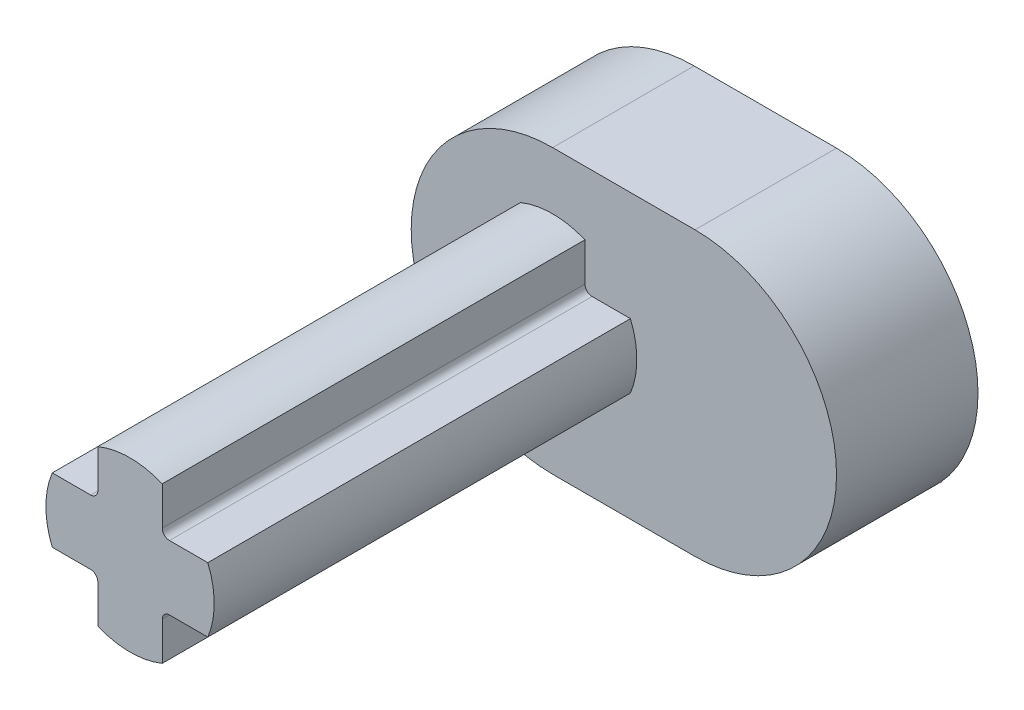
from build123d import *

# Parameters (mm, degrees)
BASE_EXTRUDE_DEPTH  = 3.95
CUT_EXTRUDE3_DEPTH  = 3.9
BOSS_EXTRUDE3_DEPTH = 0.05
CUT_EXTRUDE8_DEPTH  = 3.85
BOSS_EXTRUDE4_DEPTH = 11.8


with BuildPart() as part:
    # Sketch1 → Base-Extrude (new body)
    with BuildSketch(Plane.XY):
        with BuildLine():
            Line((3.975, 3.95), (0, 3.95))
            ThreePointArc((0, 3.95), (-3.95, 0), (0, -3.95))
            Line((0, -3.95), (3.975, -3.95))
            ThreePointArc((3.975, -3.95), (7.925, 0), (3.975, 3.95))
        make_face()
    extrude(amount=BASE_EXTRUDE_DEPTH)

    # Sketch7 → Cut-Extrude3 (cut)
    with BuildSketch(Plane(origin=(0, 0, 0), x_dir=(-1, 0, 0), z_dir=(0, 0, -1))):
        with BuildLine():
            Line((-1.298841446, 1.958446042), (-1.298841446, -1.958446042))
            ThreePointArc((-1.298841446, -1.958446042), (2.35, 0), (-1.298841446, 1.958446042))
        make_face()
    extrude(amount=-CUT_EXTRUDE3_DEPTH, mode=Mode.SUBTRACT)

    # Sketch8 → Boss-Extrude3 (add)
    # profile 1 of 6: a face of its own
    with BuildSketch(Plane(origin=(1.843932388, 2.125789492, 3.9), x_dir=(0, 1, 0), z_dir=(0, 0, -1))):
        with BuildLine():
            add(Edge.make_bspline(
                [(-2.74892309, -1.687794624), (-2.740545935, -1.688045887), (-2.72392366, -1.688544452), (-2.699306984, -1.691994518), (-2.675446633, -1.698063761), (-2.652311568, -1.706242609), (-2.63013259, -1.716677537), (-2.60907268, -1.729265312), (-2.589311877, -1.744091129), (-2.57732935, -1.755452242), (-2.571294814, -1.761173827)],
                knots=[0, 0, 0, 0, 1.018957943, 2.021855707, 3.0162028, 4.009185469, 5.002380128, 5.992645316, 6.989073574, 8, 8, 8, 8], degree=3))
            add(Edge.make_bspline(
                [(-2.571294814, -1.761173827), (-2.565662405, -1.767064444), (-2.554443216, -1.778797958), (-2.540046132, -1.798372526), (-2.527532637, -1.819132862), (-2.517418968, -1.841214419), (-2.509235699, -1.864191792), (-2.503547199, -1.887980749), (-2.499801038, -1.912367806), (-2.499422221, -1.92886935), (-2.499231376, -1.9371827)],
                knots=[0, 0, 0, 0, 1.000946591, 1.993784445, 2.979555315, 3.975955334, 4.974114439, 5.972928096, 6.978776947, 8, 8, 8, 8], degree=3))
            add(Edge.make_bspline(
                [(-2.499231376, -1.9371827), (-2.499431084, -1.945595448), (-2.499825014, -1.962189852), (-2.503383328, -1.986638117), (-2.509147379, -2.010195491), (-2.517163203, -2.032855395), (-2.52739387, -2.054470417), (-2.539868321, -2.074903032), (-2.554302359, -2.094334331), (-2.565592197, -2.105988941), (-2.571294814, -2.111875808)],
                knots=[0, 0, 0, 0, 1.039328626, 2.050107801, 3.04630548, 4.032829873, 5.015822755, 5.996291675, 6.987905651, 8, 8, 8, 8], degree=3))
            add(Edge.make_bspline(
                [(-2.571294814, -2.111875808), (-2.577457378, -2.117675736), (-2.589683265, -2.129182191), (-2.609929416, -2.144039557), (-2.631209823, -2.156964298), (-2.653577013, -2.167696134), (-2.676736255, -2.17611166), (-2.700445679, -2.182057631), (-2.724541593, -2.185885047), (-2.740778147, -2.1863417), (-2.74892309, -2.186570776)],
                knots=[0, 0, 0, 0, 1.026834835, 2.037133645, 3.042569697, 4.046736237, 5.044640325, 6.02933777, 7.011432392, 8, 8, 8, 8], degree=3))
            add(Edge.make_bspline(
                [(-2.74892309, -2.186570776), (-2.757100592, -2.186333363), (-2.773363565, -2.185861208), (-2.797434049, -2.182187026), (-2.820982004, -2.176333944), (-2.843810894, -2.167991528), (-2.865842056, -2.157518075), (-2.886616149, -2.144602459), (-2.906490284, -2.129860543), (-2.918469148, -2.118386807), (-2.924527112, -2.112584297)],
                knots=[0, 0, 0, 0, 1.00281557, 1.994345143, 2.98007901, 3.975109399, 4.971043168, 5.966942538, 6.971839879, 8, 8, 8, 8], degree=3))
            add(Edge.make_bspline(
                [(-2.924527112, -2.112584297), (-2.93029481, -2.106594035), (-2.941748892, -2.094697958), (-2.956443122, -2.074948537), (-2.969144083, -2.054121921), (-2.979644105, -2.032224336), (-2.987869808, -2.009363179), (-2.993750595, -1.985837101), (-2.997270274, -1.961681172), (-2.997760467, -1.945392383), (-2.998007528, -1.9371827)],
                knots=[0, 0, 0, 0, 1.021116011, 2.02783661, 3.017680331, 4.015421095, 5.006948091, 5.998492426, 6.991223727, 8, 8, 8, 8], degree=3))
            add(Edge.make_bspline(
                [(-2.998007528, -1.9371827), (-2.997766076, -1.929005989), (-2.997284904, -1.912711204), (-2.993653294, -1.88855578), (-2.987641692, -1.864893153), (-2.979223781, -1.841855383), (-2.968595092, -1.819598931), (-2.955869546, -1.798349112), (-2.941124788, -1.778149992), (-2.92968528, -1.76592046), (-2.923919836, -1.759756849)],
                knots=[0, 0, 0, 0, 0.994980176, 1.982825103, 2.965844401, 3.962221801, 4.963259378, 5.963294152, 6.973512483, 8, 8, 8, 8], degree=3))
            add(Edge.make_bspline(
                [(-2.923919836, -1.759756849), (-2.918055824, -1.754134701), (-2.906415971, -1.742974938), (-2.887125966, -1.728472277), (-2.866588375, -1.716031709), (-2.844772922, -1.705854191), (-2.821985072, -1.697696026), (-2.79830597, -1.691964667), (-2.773863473, -1.688389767), (-2.757302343, -1.687994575), (-2.74892309, -1.687794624)],
                knots=[0, 0, 0, 0, 1.00234497, 1.989618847, 2.972647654, 3.96216877, 4.956928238, 5.956152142, 6.965896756, 8, 8, 8, 8], degree=3))
        make_face()
        with BuildLine():
            add(Edge.make_bspline(
                [(-2.525141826, -1.937385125), (-2.52532674, -1.929951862), (-2.525694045, -1.91518672), (-2.528935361, -1.893346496), (-2.534214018, -1.872102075), (-2.5415201, -1.85153305), (-2.550720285, -1.831797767), (-2.561772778, -1.813072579), (-2.574803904, -1.795552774), (-2.584721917, -1.784871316), (-2.589715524, -1.779493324)],
                knots=[0, 0, 0, 0, 1.018933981, 2.023970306, 3.020439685, 4.01699499, 5.012615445, 6.002099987, 6.994080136, 8, 8, 8, 8], degree=3))
            add(Edge.make_bspline(
                [(-2.589715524, -1.779493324), (-2.595140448, -1.774306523), (-2.605886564, -1.764032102), (-2.623831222, -1.750908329), (-2.642641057, -1.739468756), (-2.662571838, -1.730204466), (-2.683214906, -1.722750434), (-2.70458467, -1.717506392), (-2.726555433, -1.714250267), (-2.741422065, -1.713887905), (-2.74892309, -1.713705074)],
                knots=[0, 0, 0, 0, 1.017557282, 2.015657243, 3.00970618, 4.001009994, 4.993000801, 5.983500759, 6.982566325, 8, 8, 8, 8], degree=3))
            add(Edge.make_bspline(
                [(-2.74892309, -1.713705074), (-2.756356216, -1.71389063), (-2.771121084, -1.71425921), (-2.79293087, -1.717486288), (-2.814105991, -1.722780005), (-2.834546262, -1.730068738), (-2.854099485, -1.739250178), (-2.872505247, -1.750391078), (-2.889868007, -1.763200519), (-2.900270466, -1.773167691), (-2.905499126, -1.778177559)],
                knots=[0, 0, 0, 0, 1.025734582, 2.03747875, 3.036079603, 4.034897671, 5.028729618, 6.012822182, 7.001171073, 8, 8, 8, 8], degree=3))
            add(Edge.make_bspline(
                [(-2.905499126, -1.778177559), (-2.910664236, -1.783756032), (-2.920893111, -1.794803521), (-2.934318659, -1.81285382), (-2.945795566, -1.831946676), (-2.955306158, -1.851988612), (-2.962780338, -1.872704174), (-2.968225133, -1.893905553), (-2.971401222, -1.915528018), (-2.971864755, -1.930087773), (-2.972097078, -1.937385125)],
                knots=[0, 0, 0, 0, 1.030362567, 2.040508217, 3.044001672, 4.046733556, 5.043824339, 6.025813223, 7.010537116, 8, 8, 8, 8], degree=3))
            add(Edge.make_bspline(
                [(-2.972097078, -1.937385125), (-2.971867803, -1.944682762), (-2.971412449, -1.959176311), (-2.968217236, -1.980696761), (-2.962773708, -2.00171594), (-2.955429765, -2.022249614), (-2.946024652, -2.042001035), (-2.934604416, -2.060672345), (-2.921429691, -2.078346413), (-2.911310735, -2.089062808), (-2.906207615, -2.094467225)],
                knots=[0, 0, 0, 0, 1.001897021, 1.989828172, 2.979668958, 3.97900318, 4.979796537, 5.977647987, 6.980101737, 8, 8, 8, 8], degree=3))
            add(Edge.make_bspline(
                [(-2.906207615, -2.094467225), (-2.900801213, -2.099567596), (-2.890046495, -2.109713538), (-2.872358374, -2.12295087), (-2.853615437, -2.134370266), (-2.833894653, -2.143888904), (-2.813373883, -2.151357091), (-2.792302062, -2.1567865), (-2.770747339, -2.15997015), (-2.756220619, -2.160429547), (-2.74892309, -2.160660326)],
                knots=[0, 0, 0, 0, 1.018033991, 2.025130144, 3.021157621, 4.022120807, 5.021202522, 6.009233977, 6.999934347, 8, 8, 8, 8], degree=3))
            add(Edge.make_bspline(
                [(-2.74892309, -2.160660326), (-2.741623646, -2.160440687), (-2.727054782, -2.160002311), (-2.705426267, -2.156630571), (-2.684147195, -2.151296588), (-2.663400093, -2.14363226), (-2.643323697, -2.134073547), (-2.624194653, -2.122572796), (-2.606155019, -2.109209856), (-2.595219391, -2.0989317), (-2.589715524, -2.093758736)],
                knots=[0, 0, 0, 0, 0.988726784, 1.973386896, 2.95907585, 3.956986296, 4.965064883, 5.967811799, 6.977205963, 8, 8, 8, 8], degree=3))
            add(Edge.make_bspline(
                [(-2.589715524, -2.093758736), (-2.584629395, -2.088503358), (-2.574526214, -2.078063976), (-2.561703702, -2.060583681), (-2.550341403, -2.042320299), (-2.541344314, -2.022819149), (-2.534064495, -2.002512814), (-2.528968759, -1.981407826), (-2.525674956, -1.959620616), (-2.525320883, -1.944853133), (-2.525141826, -1.937385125)],
                knots=[0, 0, 0, 0, 1.008934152, 2.004165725, 2.987050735, 3.975046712, 4.963888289, 5.961734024, 6.969236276, 8, 8, 8, 8], degree=3))
        make_face(mode=Mode.SUBTRACT)
    # profile 2 of 6: a face of its own
    with BuildSketch(Plane(origin=(1.843932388, 2.125789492, 3.9), x_dir=(0, 1, 0), z_dir=(0, 0, -1))):
        with BuildLine():
            add(Edge.make_bspline(
                [(-2.680604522, -1.873317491), (-2.681806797, -1.869111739), (-2.684152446, -1.860906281), (-2.690068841, -1.849790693), (-2.697443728, -1.840021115), (-2.706540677, -1.831945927), (-2.716943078, -1.825365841), (-2.728677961, -1.820715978), (-2.74156101, -1.817796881), (-2.750559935, -1.81749993), (-2.755198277, -1.817346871)],
                knots=[0, 0, 0, 0, 1.034583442, 2.018481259, 2.965600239, 3.922832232, 4.88602793, 5.869340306, 6.901787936, 8, 8, 8, 8], degree=3))
            add(Edge.make_bspline(
                [(-2.755198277, -1.817346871), (-2.758544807, -1.817437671), (-2.765104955, -1.817615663), (-2.774634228, -1.819196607), (-2.78362215, -1.821583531), (-2.792047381, -1.825056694), (-2.799831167, -1.829651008), (-2.807070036, -1.835151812), (-2.813748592, -1.841625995), (-2.819754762, -1.849093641), (-2.825140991, -1.857441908), (-2.829799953, -1.86660501), (-2.833742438, -1.876571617), (-2.836971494, -1.887342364), (-2.839477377, -1.898917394), (-2.841313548, -1.911289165), (-2.842270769, -1.92448231), (-2.842451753, -1.9335377), (-2.842544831, -1.938194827)],
                knots=[0, 0, 0, 0, 0.954364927, 1.870826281, 2.749014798, 3.603666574, 4.462321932, 5.321139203, 6.192652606, 7.109872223, 8.049900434, 9.023020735, 10.038511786, 11.104546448, 12.228195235, 13.415499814, 14.67080855, 16, 16, 16, 16], degree=3))
            add(Edge.make_bspline(
                [(-2.842544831, -1.938194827), (-2.842461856, -1.942650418), (-2.842300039, -1.951339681), (-2.84119489, -1.964024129), (-2.83929922, -1.976007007), (-2.836546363, -1.987265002), (-2.833131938, -1.997849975), (-2.828909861, -2.007707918), (-2.823754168, -2.016764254), (-2.818070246, -2.025184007), (-2.811577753, -2.032650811), (-2.80456285, -2.039224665), (-2.796928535, -2.044711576), (-2.788726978, -2.049196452), (-2.780025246, -2.052795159), (-2.770680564, -2.05516135), (-2.760853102, -2.056751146), (-2.75409151, -2.056928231), (-2.750643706, -2.057018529)],
                knots=[0, 0, 0, 0, 1.263666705, 2.46439412, 3.608060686, 4.701172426, 5.748162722, 6.759612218, 7.736430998, 8.699894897, 9.636077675, 10.536616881, 11.420945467, 12.294596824, 13.183057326, 14.083596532, 15.022806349, 16, 16, 16, 16], degree=3))
            add(Edge.make_bspline(
                [(-2.750643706, -2.057018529), (-2.745567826, -2.056797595), (-2.735685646, -2.056367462), (-2.721413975, -2.053224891), (-2.708338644, -2.047730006), (-2.696496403, -2.040281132), (-2.686243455, -2.030931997), (-2.677820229, -2.02006891), (-2.671362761, -2.007731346), (-2.668903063, -1.998745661), (-2.667649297, -1.994165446)],
                knots=[0, 0, 0, 0, 1.079119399, 2.10092667, 3.088298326, 4.081569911, 5.061799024, 6.023337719, 6.992448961, 8, 8, 8, 8], degree=3))
            Line((-2.667649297, -1.994165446), (-2.635261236, -1.994165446))
            add(Edge.make_bspline(
                [(-2.635261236, -1.994165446), (-2.635663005, -1.997585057), (-2.636457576, -2.004347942), (-2.638861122, -2.014156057), (-2.641937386, -2.023564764), (-2.646142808, -2.032401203), (-2.651254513, -2.040761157), (-2.657234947, -2.048679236), (-2.664161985, -2.056097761), (-2.671955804, -2.062934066), (-2.680361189, -2.069172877), (-2.689352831, -2.074575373), (-2.698804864, -2.079146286), (-2.708765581, -2.082898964), (-2.719231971, -2.085827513), (-2.730192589, -2.087969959), (-2.741642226, -2.089174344), (-2.74942643, -2.089328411), (-2.753376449, -2.08940659)],
                knots=[0, 0, 0, 0, 0.986260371, 1.95050462, 2.889531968, 3.819800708, 4.748761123, 5.694736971, 6.65970864, 7.65334055, 8.66317646, 9.65680837, 10.656120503, 11.66933233, 12.704332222, 13.768524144, 14.867659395, 16, 16, 16, 16], degree=3))
            add(Edge.make_bspline(
                [(-2.753376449, -2.08940659), (-2.758175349, -2.089314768), (-2.76754887, -2.089135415), (-2.781174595, -2.087013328), (-2.794025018, -2.083780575), (-2.806199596, -2.079352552), (-2.817542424, -2.07342589), (-2.828182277, -2.066279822), (-2.838044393, -2.057835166), (-2.84704038, -2.048092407), (-2.855069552, -2.037260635), (-2.862285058, -2.025584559), (-2.868090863, -2.01281948), (-2.872939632, -1.999236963), (-2.876832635, -1.98476086), (-2.879498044, -1.969381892), (-2.881167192, -1.953076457), (-2.881327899, -1.941910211), (-2.881410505, -1.936170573)],
                knots=[0, 0, 0, 0, 1.021960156, 1.996158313, 2.930921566, 3.843207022, 4.750120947, 5.651545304, 6.569508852, 7.510803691, 8.471453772, 9.439502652, 10.430355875, 11.453832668, 12.510809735, 13.620872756, 14.777088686, 16, 16, 16, 16], degree=3))
            add(Edge.make_bspline(
                [(-2.881410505, -1.936170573), (-2.881280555, -1.930566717), (-2.881027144, -1.919638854), (-2.879444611, -1.903686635), (-2.876600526, -1.888623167), (-2.872624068, -1.874420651), (-2.867734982, -1.860974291), (-2.861511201, -1.848478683), (-2.854177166, -1.836852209), (-2.845778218, -1.826159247), (-2.836528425, -1.816408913), (-2.826360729, -1.808016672), (-2.815566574, -1.800829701), (-2.804021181, -1.795060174), (-2.791794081, -1.790434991), (-2.778811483, -1.787256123), (-2.765145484, -1.785262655), (-2.755812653, -1.785061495), (-2.751048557, -1.78495881)],
                knots=[0, 0, 0, 0, 1.196898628, 2.334025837, 3.419361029, 4.466545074, 5.481092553, 6.470377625, 7.441922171, 8.411995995, 9.370087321, 10.306500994, 11.221801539, 12.13374922, 13.057210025, 14.007902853, 14.983101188, 16, 16, 16, 16], degree=3))
            add(Edge.make_bspline(
                [(-2.751048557, -1.78495881), (-2.747436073, -1.785043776), (-2.740328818, -1.785210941), (-2.729897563, -1.786312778), (-2.719875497, -1.788249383), (-2.710302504, -1.790983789), (-2.701125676, -1.794397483), (-2.692445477, -1.798727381), (-2.684172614, -1.803758), (-2.676388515, -1.8095264), (-2.669244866, -1.815862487), (-2.662799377, -1.822671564), (-2.657196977, -1.829997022), (-2.652452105, -1.83781616), (-2.64844479, -1.846028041), (-2.645449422, -1.854749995), (-2.643055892, -1.863843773), (-2.642181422, -1.870133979), (-2.641738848, -1.873317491)],
                knots=[0, 0, 0, 0, 1.121250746, 2.205965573, 3.251297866, 4.285503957, 5.292962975, 6.285785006, 7.291501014, 8.29470614, 9.288687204, 10.251738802, 11.200508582, 12.145166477, 13.086568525, 14.030471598, 15.003209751, 16, 16, 16, 16], degree=3))
            Line((-2.641738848, -1.873317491), (-2.680604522, -1.873317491))
        make_face()
    # profile 3 of 6: a face of its own
    with BuildSketch(Plane(origin=(1.843932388, 2.125789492, 3.9), x_dir=(0, 1, 0), z_dir=(0, 0, -1))):
        Polygon((-2.45388809, -2.180093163), (-2.347311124, -1.6748394), (-2.300449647, -1.6748394), (-2.400447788, -2.141227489), (-2.227171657, -2.141227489), (-2.235471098, -2.180093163), align=None)
    # profile 4 of 6: a face of its own
    with BuildSketch(Plane(origin=(1.843932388, 2.125789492, 3.9), x_dir=(0, 1, 0), z_dir=(0, 0, -1))):
        Polygon((-2.194783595, -2.180093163), (-2.089117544, -1.6748394), (-1.864425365, -1.6748394), (-1.872421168, -1.713705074), (-2.053187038, -1.713705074), (-2.092457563, -1.89507822), (-1.922723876, -1.89507822), (-1.930314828, -1.933943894), (-2.099947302, -1.933943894), (-2.141849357, -2.141227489), (-1.961589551, -2.141227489), (-1.968876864, -2.180093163), align=None)
    # profile 5 of 6: a face of its own
    with BuildSketch(Plane(origin=(1.843932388, 2.125789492, 3.9), x_dir=(0, 1, 0), z_dir=(0, 0, -1))):
        with BuildLine():
            add(Edge.make_bspline(
                [(-1.603903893, -2.170984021), (-1.609905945, -2.172181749), (-1.621592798, -2.174513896), (-1.638701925, -2.177636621), (-1.654918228, -2.180422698), (-1.670242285, -2.182628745), (-1.684649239, -2.18439339), (-1.698121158, -2.185559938), (-1.710636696, -2.18648995), (-1.718677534, -2.186544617), (-1.72252517, -2.186570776)],
                knots=[0, 0, 0, 0, 1.225832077, 2.386870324, 3.483325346, 4.521138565, 5.487527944, 6.389900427, 7.229548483, 8, 8, 8, 8], degree=3))
            add(Edge.make_bspline(
                [(-1.72252517, -2.186570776), (-1.728197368, -2.186488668), (-1.739229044, -2.18632898), (-1.755227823, -2.184665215), (-1.770156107, -2.182074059), (-1.78403585, -2.17846006), (-1.796810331, -2.173694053), (-1.808570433, -2.167948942), (-1.819158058, -2.160983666), (-1.828742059, -2.153083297), (-1.837206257, -2.144105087), (-1.844531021, -2.134104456), (-1.850760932, -2.123115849), (-1.8556757, -2.111040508), (-1.859625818, -2.098069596), (-1.862480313, -2.084080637), (-1.864040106, -2.06909842), (-1.864294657, -2.058776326), (-1.864425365, -2.053476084)],
                knots=[0, 0, 0, 0, 1.222313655, 2.377238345, 3.462882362, 4.486000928, 5.464004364, 6.397432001, 7.301091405, 8.189403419, 9.069130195, 9.953503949, 10.85555242, 11.784749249, 12.757873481, 13.774795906, 14.85739087, 16, 16, 16, 16], degree=3))
            add(Edge.make_bspline(
                [(-1.864425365, -2.053476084), (-1.864326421, -2.049493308), (-1.864110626, -2.040806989), (-1.862927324, -2.026759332), (-1.860974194, -2.010593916), (-1.858689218, -1.995808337), (-1.856631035, -1.9827451), (-1.854635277, -1.971973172), (-1.852698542, -1.960406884), (-1.850278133, -1.948189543), (-1.847919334, -1.935174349), (-1.845145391, -1.921457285), (-1.842224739, -1.906980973), (-1.840172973, -1.897101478), (-1.839122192, -1.892041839)],
                knots=[0, 0, 0, 0, 0.876487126, 1.911592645, 3.100341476, 4.458879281, 5.203351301, 6.010101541, 6.869316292, 7.783654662, 8.750433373, 9.779746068, 10.862929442, 12, 12, 12, 12], degree=3))
            add(Edge.make_bspline(
                [(-1.839122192, -1.892041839), (-1.838016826, -1.887013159), (-1.835871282, -1.87725236), (-1.832604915, -1.863021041), (-1.829473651, -1.849592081), (-1.826489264, -1.836952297), (-1.82341429, -1.825195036), (-1.820471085, -1.814232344), (-1.817673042, -1.8040665), (-1.814104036, -1.791886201), (-1.809694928, -1.778164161), (-1.804245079, -1.763367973), (-1.798896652, -1.750628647), (-1.794843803, -1.743098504), (-1.792969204, -1.739615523)],
                knots=[0, 0, 0, 0, 1.160392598, 2.252352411, 3.290740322, 4.268182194, 5.179221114, 6.029501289, 6.826431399, 7.555467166, 8.890004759, 10.073631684, 11.108980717, 12, 12, 12, 12], degree=3))
            add(Edge.make_bspline(
                [(-1.792969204, -1.739615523), (-1.789083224, -1.733359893), (-1.78150627, -1.721162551), (-1.767659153, -1.705185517), (-1.75249105, -1.691640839), (-1.735752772, -1.680641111), (-1.717357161, -1.672169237), (-1.697338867, -1.666120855), (-1.675588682, -1.662546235), (-1.660563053, -1.662109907), (-1.652789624, -1.661884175)],
                knots=[0, 0, 0, 0, 1.045860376, 2.039237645, 2.994234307, 3.929665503, 4.876250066, 5.864225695, 6.895068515, 8, 8, 8, 8], degree=3))
            add(Edge.make_bspline(
                [(-1.652789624, -1.661884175), (-1.647725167, -1.661976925), (-1.637842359, -1.662157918), (-1.623456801, -1.663690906), (-1.609915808, -1.666213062), (-1.597250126, -1.669693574), (-1.585528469, -1.674331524), (-1.574587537, -1.679733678), (-1.564625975, -1.686411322), (-1.555493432, -1.693971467), (-1.547405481, -1.702489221), (-1.540318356, -1.71180821), (-1.534339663, -1.721963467), (-1.529455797, -1.732967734), (-1.525758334, -1.744766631), (-1.522990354, -1.757322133), (-1.521364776, -1.770712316), (-1.521197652, -1.779927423), (-1.52111191, -1.784655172)],
                knots=[0, 0, 0, 0, 1.187988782, 2.318247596, 3.389450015, 4.41694543, 5.394441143, 6.343149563, 7.273990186, 8.201324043, 9.119525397, 10.023491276, 10.942545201, 11.878052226, 12.841830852, 13.83862194, 14.891119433, 16, 16, 16, 16], degree=3))
            add(Edge.make_bspline(
                [(-1.52111191, -1.784655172), (-1.521169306, -1.78644365), (-1.521301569, -1.790564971), (-1.521797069, -1.797528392), (-1.522895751, -1.806016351), (-1.523708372, -1.812185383), (-1.524148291, -1.815525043)],
                knots=[0, 0, 0, 0, 0.691807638, 1.594182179, 2.69758897, 4, 4, 4, 4], degree=3))
            Line((-1.524148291, -1.815525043), (-1.524148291, -1.817346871))
            Line((-1.524148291, -1.817346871), (-1.568580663, -1.817346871))
            add(Edge.make_bspline(
                [(-1.568580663, -1.817346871), (-1.568215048, -1.814988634), (-1.567522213, -1.810519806), (-1.566956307, -1.803959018), (-1.566488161, -1.79778595), (-1.566466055, -1.79373148), (-1.566455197, -1.79174006)],
                knots=[0, 0, 0, 0, 1.112961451, 2.109046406, 3.071227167, 4, 4, 4, 4], degree=3))
            add(Edge.make_bspline(
                [(-1.566455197, -1.79174006), (-1.566549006, -1.788229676), (-1.566731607, -1.781396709), (-1.567679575, -1.771462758), (-1.569544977, -1.762158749), (-1.572055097, -1.753446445), (-1.575266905, -1.745266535), (-1.579376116, -1.737791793), (-1.584019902, -1.73079433), (-1.589510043, -1.724553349), (-1.595609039, -1.718939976), (-1.602340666, -1.71406489), (-1.609649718, -1.709872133), (-1.617625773, -1.706560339), (-1.626153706, -1.703890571), (-1.635290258, -1.702136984), (-1.645000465, -1.700979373), (-1.651672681, -1.700828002), (-1.655117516, -1.700749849)],
                knots=[0, 0, 0, 0, 1.166547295, 2.270685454, 3.310422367, 4.31425725, 5.280012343, 6.222860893, 7.143051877, 8.064607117, 8.976914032, 9.89162764, 10.820312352, 11.769601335, 12.755186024, 13.783929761, 14.855852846, 16, 16, 16, 16], degree=3))
            add(Edge.make_bspline(
                [(-1.655117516, -1.700749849), (-1.660801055, -1.700923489), (-1.671855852, -1.70126123), (-1.687746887, -1.704469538), (-1.702333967, -1.709638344), (-1.715616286, -1.716927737), (-1.727677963, -1.726472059), (-1.73860789, -1.738282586), (-1.74874715, -1.752266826), (-1.754332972, -1.762783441), (-1.757241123, -1.768258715)],
                knots=[0, 0, 0, 0, 1.048026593, 2.038469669, 2.978039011, 3.894986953, 4.821840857, 5.804264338, 6.85683226, 8, 8, 8, 8], degree=3))
            add(Edge.make_bspline(
                [(-1.757241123, -1.768258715), (-1.758667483, -1.771242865), (-1.76180777, -1.777812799), (-1.765905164, -1.788962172), (-1.770289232, -1.802048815), (-1.773813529, -1.814288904), (-1.776911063, -1.825205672), (-1.779133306, -1.83449515), (-1.781724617, -1.844524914), (-1.784361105, -1.85538816), (-1.787024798, -1.867085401), (-1.790048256, -1.879532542), (-1.792906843, -1.892824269), (-1.794952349, -1.901928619), (-1.796005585, -1.906616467)],
                knots=[0, 0, 0, 0, 0.826735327, 1.820148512, 2.967388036, 4.278160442, 5.00481677, 5.804905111, 6.666383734, 7.595406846, 8.600254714, 9.666453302, 10.798452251, 12, 12, 12, 12], degree=3))
            add(Edge.make_bspline(
                [(-1.796005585, -1.906616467), (-1.797111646, -1.911982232), (-1.799247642, -1.922344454), (-1.802438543, -1.937231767), (-1.805107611, -1.950989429), (-1.807736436, -1.963507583), (-1.809757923, -1.974943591), (-1.811781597, -1.985135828), (-1.813220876, -1.994169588), (-1.815011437, -2.004292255), (-1.816500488, -2.015472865), (-1.817991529, -2.027508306), (-1.818840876, -2.03797848), (-1.819006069, -2.044433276), (-1.819082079, -2.047403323)],
                knots=[0, 0, 0, 0, 1.380724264, 2.666417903, 3.83700122, 4.912538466, 5.889783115, 6.763609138, 7.531013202, 8.194978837, 9.354142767, 10.372930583, 11.251336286, 12, 12, 12, 12], degree=3))
            add(Edge.make_bspline(
                [(-1.819082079, -2.047403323), (-1.819009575, -2.051219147), (-1.818868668, -2.058635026), (-1.817626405, -2.069434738), (-1.815623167, -2.079599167), (-1.812791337, -2.089162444), (-1.809136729, -2.098117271), (-1.804696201, -2.106454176), (-1.799373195, -2.114110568), (-1.793289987, -2.121090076), (-1.786544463, -2.127392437), (-1.779041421, -2.132760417), (-1.771080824, -2.137453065), (-1.762443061, -2.141219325), (-1.753255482, -2.144162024), (-1.743404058, -2.146121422), (-1.733023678, -2.147519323), (-1.725870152, -2.147642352), (-1.722221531, -2.147705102)],
                knots=[0, 0, 0, 0, 1.159097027, 2.25265184, 3.298060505, 4.303502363, 5.27816348, 6.232119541, 7.167667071, 8.105010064, 9.040782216, 9.96554058, 10.902659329, 11.843582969, 12.822654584, 13.827887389, 14.892124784, 16, 16, 16, 16], degree=3))
            add(Edge.make_bspline(
                [(-1.722221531, -2.147705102), (-1.715199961, -2.147592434), (-1.701469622, -2.147372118), (-1.681274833, -2.14552725), (-1.661827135, -2.142372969), (-1.649291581, -2.139036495), (-1.643073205, -2.137381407)],
                knots=[0, 0, 0, 0, 1.052006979, 2.057148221, 3.036230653, 4, 4, 4, 4], degree=3))
            Line((-1.643073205, -2.137381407), (-1.603195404, -1.959854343))
            Line((-1.603195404, -1.959854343), (-1.715440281, -1.959854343))
            Line((-1.715440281, -1.959854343), (-1.707039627, -1.920988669))
            Line((-1.707039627, -1.920988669), (-1.553499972, -1.920988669))
            Line((-1.553499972, -1.920988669), (-1.588114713, -2.094467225))
            add(Edge.make_bspline(
                [(-1.588114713, -2.094467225), (-1.589311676, -2.099760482), (-1.591792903, -2.11073307), (-1.594705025, -2.124849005), (-1.597087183, -2.137111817), (-1.599099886, -2.147478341), (-1.60144941, -2.158870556), (-1.603062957, -2.166833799), (-1.603903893, -2.170984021)],
                knots=[0, 0, 0, 0, 1.25022728, 2.591642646, 3.320264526, 4.128149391, 5.0244431, 6, 6, 6, 6], degree=3))
        make_face()
    # profile 6 of 6: a face of its own
    with BuildSketch(Plane(origin=(1.843932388, 2.125789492, 3.9), x_dir=(0, 1, 0), z_dir=(0, 0, -1))):
        with BuildLine():
            add(Edge.make_bspline(
                [(-1.488723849, -2.056107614), (-1.488635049, -2.051955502), (-1.488438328, -2.042757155), (-1.487001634, -2.027732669), (-1.484718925, -2.010161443), (-1.481658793, -1.990052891), (-1.477834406, -1.967367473), (-1.472962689, -1.942237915), (-1.467710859, -1.914563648), (-1.463627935, -1.895374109), (-1.461497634, -1.885361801)],
                knots=[0, 0, 0, 0, 0.575618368, 1.2751913, 2.090889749, 3.032200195, 4.094896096, 5.28012256, 6.580880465, 8, 8, 8, 8], degree=3))
            add(Edge.make_bspline(
                [(-1.461497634, -1.885361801), (-1.459731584, -1.876981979), (-1.456303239, -1.860714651), (-1.450396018, -1.837252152), (-1.444779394, -1.81524859), (-1.438695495, -1.795105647), (-1.432814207, -1.777040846), (-1.427235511, -1.761511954), (-1.421941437, -1.748695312), (-1.418088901, -1.741314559), (-1.416356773, -1.73799612)],
                knots=[0, 0, 0, 0, 1.329892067, 2.581652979, 3.757237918, 4.856338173, 5.848855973, 6.707462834, 7.418866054, 8, 8, 8, 8], degree=3))
            add(Edge.make_bspline(
                [(-1.416356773, -1.73799612), (-1.414366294, -1.734769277), (-1.410444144, -1.728410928), (-1.404076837, -1.719403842), (-1.397382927, -1.711120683), (-1.390502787, -1.703433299), (-1.383207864, -1.696587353), (-1.375677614, -1.690402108), (-1.36797527, -1.684741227), (-1.357061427, -1.678248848), (-1.342179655, -1.671519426), (-1.322574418, -1.665945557), (-1.301066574, -1.662428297), (-1.286076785, -1.662069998), (-1.27830266, -1.661884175)],
                knots=[0, 0, 0, 0, 0.82075713, 1.617264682, 2.386162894, 3.125665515, 3.849083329, 4.549605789, 5.234880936, 5.916369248, 7.29592212, 8.756850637, 10.318011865, 12, 12, 12, 12], degree=3))
            add(Edge.make_bspline(
                [(-1.27830266, -1.661884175), (-1.273068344, -1.661964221), (-1.262910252, -1.662119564), (-1.248161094, -1.663808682), (-1.234325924, -1.666370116), (-1.221446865, -1.670115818), (-1.209514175, -1.674896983), (-1.198495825, -1.6806404), (-1.188485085, -1.687599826), (-1.179482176, -1.695615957), (-1.171403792, -1.704588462), (-1.164395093, -1.714540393), (-1.158538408, -1.725477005), (-1.153582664, -1.737270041), (-1.150070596, -1.750125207), (-1.14728538, -1.763806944), (-1.145659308, -1.778475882), (-1.145495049, -1.78856474), (-1.145410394, -1.793764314)],
                knots=[0, 0, 0, 0, 1.175277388, 2.280828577, 3.330169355, 4.332652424, 5.288203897, 6.213680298, 7.11765186, 8.019524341, 8.915743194, 9.824056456, 10.746424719, 11.697819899, 12.690920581, 13.734278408, 14.832297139, 16, 16, 16, 16], degree=3))
            add(Edge.make_bspline(
                [(-1.145410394, -1.793764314), (-1.145506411, -1.797612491), (-1.145714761, -1.805962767), (-1.146951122, -1.819528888), (-1.14873001, -1.835131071), (-1.150940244, -1.849481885), (-1.153041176, -1.862154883), (-1.154854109, -1.872857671), (-1.157012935, -1.884451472), (-1.159301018, -1.89701586), (-1.161967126, -1.910430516), (-1.164785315, -1.924778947), (-1.167946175, -1.940016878), (-1.170107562, -1.950508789), (-1.17121963, -1.955907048)],
                knots=[0, 0, 0, 0, 0.842807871, 1.828834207, 2.981748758, 4.28162173, 5.007991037, 5.795100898, 6.658829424, 7.590630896, 8.591902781, 9.654024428, 10.792957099, 12, 12, 12, 12], degree=3))
            add(Edge.make_bspline(
                [(-1.17121963, -1.955907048), (-1.172400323, -1.961305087), (-1.174688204, -1.971765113), (-1.178020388, -1.986989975), (-1.181226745, -2.001201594), (-1.184394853, -2.014420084), (-1.18739059, -2.02661031), (-1.19034625, -2.03780713), (-1.193184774, -2.047985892), (-1.196578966, -2.059973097), (-1.200730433, -2.073343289), (-1.206026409, -2.087685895), (-1.211247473, -2.100103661), (-1.215291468, -2.107450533), (-1.217170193, -2.110863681)],
                knots=[0, 0, 0, 0, 1.226824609, 2.37727363, 3.460296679, 4.461369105, 5.395165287, 6.247276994, 7.032354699, 7.741269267, 9.013447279, 10.139147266, 11.135500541, 12, 12, 12, 12], degree=3))
            add(Edge.make_bspline(
                [(-1.217170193, -2.110863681), (-1.219012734, -2.11403104), (-1.22263507, -2.120257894), (-1.228814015, -2.128984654), (-1.235186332, -2.137166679), (-1.24208548, -2.144614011), (-1.249208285, -2.151492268), (-1.256760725, -2.157709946), (-1.264675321, -2.163295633), (-1.273001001, -2.168264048), (-1.281753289, -2.172652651), (-1.29096965, -2.17637215), (-1.300636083, -2.17953806), (-1.310796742, -2.182037), (-1.321440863, -2.184046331), (-1.332579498, -2.185615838), (-1.3442154, -2.186365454), (-1.352119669, -2.186501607), (-1.356135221, -2.186570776)],
                knots=[0, 0, 0, 0, 1.052351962, 2.068866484, 3.069589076, 4.030112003, 4.98312133, 5.91277099, 6.837962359, 7.763965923, 8.696038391, 9.648307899, 10.617013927, 11.616232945, 12.652386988, 13.728578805, 14.84606553, 16, 16, 16, 16], degree=3))
            add(Edge.make_bspline(
                [(-1.356135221, -2.186570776), (-1.361267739, -2.186486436), (-1.371256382, -2.186322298), (-1.385784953, -2.184681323), (-1.3993963, -2.181960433), (-1.412133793, -2.178200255), (-1.424041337, -2.173478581), (-1.435053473, -2.167581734), (-1.445108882, -2.160547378), (-1.454284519, -2.152541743), (-1.462387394, -2.143466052), (-1.469521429, -2.133562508), (-1.475383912, -2.12270284), (-1.480275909, -2.111080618), (-1.484134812, -2.098576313), (-1.486819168, -2.085182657), (-1.488479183, -2.070926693), (-1.488640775, -2.06113925), (-1.488723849, -2.056107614)],
                knots=[0, 0, 0, 0, 1.16414172, 2.265592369, 3.311935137, 4.309808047, 5.274966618, 6.213345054, 7.137059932, 8.05373864, 8.969777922, 9.891651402, 10.816570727, 11.763403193, 12.74883821, 13.780177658, 14.858809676, 16, 16, 16, 16], degree=3))
        make_face()
        with BuildLine():
            add(Edge.make_bspline(
                [(-1.281237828, -1.700749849), (-1.287021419, -1.700891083), (-1.298164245, -1.701163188), (-1.314030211, -1.704169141), (-1.328338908, -1.708872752), (-1.341157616, -1.715699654), (-1.352651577, -1.724934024), (-1.363228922, -1.736573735), (-1.373067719, -1.750761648), (-1.378624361, -1.761441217), (-1.381539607, -1.767044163)],
                knots=[0, 0, 0, 0, 1.080335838, 2.08140476, 3.007134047, 3.887802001, 4.781481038, 5.750383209, 6.819757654, 8, 8, 8, 8], degree=3))
            add(Edge.make_bspline(
                [(-1.381539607, -1.767044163), (-1.382753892, -1.769695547), (-1.385542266, -1.775783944), (-1.389345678, -1.786405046), (-1.393623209, -1.799526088), (-1.398045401, -1.815013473), (-1.402763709, -1.832492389), (-1.407613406, -1.851584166), (-1.412484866, -1.872164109), (-1.415571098, -1.886402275), (-1.417166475, -1.893762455)],
                knots=[0, 0, 0, 0, 0.530694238, 1.218638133, 2.051874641, 3.043172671, 4.150157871, 5.347821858, 6.629001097, 8, 8, 8, 8], degree=3))
            add(Edge.make_bspline(
                [(-1.417166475, -1.893762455), (-1.418321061, -1.89932763), (-1.420552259, -1.910082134), (-1.423674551, -1.92574628), (-1.426646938, -1.94037452), (-1.429217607, -1.954022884), (-1.431725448, -1.966619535), (-1.433777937, -1.978211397), (-1.43577298, -1.988786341), (-1.437811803, -2.001138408), (-1.440026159, -2.014810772), (-1.441831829, -2.029431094), (-1.443054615, -2.041749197), (-1.443279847, -2.049223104), (-1.443380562, -2.05256517)],
                knots=[0, 0, 0, 0, 1.269945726, 2.454125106, 3.568819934, 4.605187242, 5.557279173, 6.438514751, 7.235470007, 7.961690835, 9.235746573, 10.329704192, 11.25310301, 12, 12, 12, 12], degree=3))
            add(Edge.make_bspline(
                [(-1.443380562, -2.05256517), (-1.443298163, -2.056211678), (-1.443136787, -2.063353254), (-1.4420172, -2.07374245), (-1.440219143, -2.083496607), (-1.437683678, -2.09262472), (-1.43436198, -2.101105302), (-1.430281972, -2.108971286), (-1.42550084, -2.116200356), (-1.420030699, -2.12281138), (-1.413853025, -2.128700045), (-1.406989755, -2.133771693), (-1.399609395, -2.138190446), (-1.391503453, -2.1415967), (-1.382892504, -2.144308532), (-1.373698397, -2.146404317), (-1.363851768, -2.147449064), (-1.35708187, -2.147618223), (-1.353604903, -2.147705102)],
                knots=[0, 0, 0, 0, 1.177093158, 2.305301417, 3.369110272, 4.375974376, 5.358932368, 6.303989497, 7.231370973, 8.151754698, 9.068522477, 9.979058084, 10.901823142, 11.838559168, 12.809923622, 13.814074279, 14.877325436, 16, 16, 16, 16], degree=3))
            add(Edge.make_bspline(
                [(-1.353604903, -2.147705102), (-1.347922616, -2.147521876), (-1.336982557, -2.147169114), (-1.321278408, -2.144158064), (-1.306980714, -2.13935727), (-1.29397803, -2.132427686), (-1.282228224, -2.12316193), (-1.271500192, -2.111576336), (-1.261600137, -2.097693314), (-1.256145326, -2.087254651), (-1.253303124, -2.081815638)],
                knots=[0, 0, 0, 0, 1.066706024, 2.053720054, 2.991776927, 3.890687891, 4.807366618, 5.789382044, 6.848168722, 8, 8, 8, 8], degree=3))
            add(Edge.make_bspline(
                [(-1.253303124, -2.081815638), (-1.251956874, -2.078758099), (-1.249001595, -2.072046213), (-1.24490991, -2.060828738), (-1.240816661, -2.047589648), (-1.236420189, -2.032237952), (-1.231748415, -2.014423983), (-1.226841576, -1.993854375), (-1.221470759, -1.970474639), (-1.217861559, -1.953920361), (-1.215955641, -1.945178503)],
                knots=[0, 0, 0, 0, 0.565071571, 1.240440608, 2.018442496, 2.909050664, 3.941793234, 5.133691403, 6.486381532, 8, 8, 8, 8], degree=3))
            add(Edge.make_bspline(
                [(-1.215955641, -1.945178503), (-1.214769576, -1.939680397), (-1.212478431, -1.9290596), (-1.209255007, -1.913705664), (-1.206301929, -1.899505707), (-1.203671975, -1.886448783), (-1.201335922, -1.874540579), (-1.199350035, -1.863764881), (-1.197445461, -1.854176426), (-1.19568391, -1.843160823), (-1.193672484, -1.831045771), (-1.19211075, -1.818007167), (-1.190952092, -1.806841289), (-1.190815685, -1.800008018), (-1.19075368, -1.796901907)],
                knots=[0, 0, 0, 0, 1.344629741, 2.597447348, 3.750577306, 4.811939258, 5.781569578, 6.65158919, 7.431436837, 8.118277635, 9.318319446, 10.366731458, 11.257586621, 12, 12, 12, 12], degree=3))
            add(Edge.make_bspline(
                [(-1.19075368, -1.796901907), (-1.190849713, -1.793156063), (-1.191036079, -1.785886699), (-1.191952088, -1.77526691), (-1.193965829, -1.765382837), (-1.196388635, -1.756080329), (-1.199832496, -1.747564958), (-1.203711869, -1.739527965), (-1.208625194, -1.732303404), (-1.214097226, -1.725639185), (-1.220285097, -1.719759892), (-1.227158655, -1.714650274), (-1.234609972, -1.71029495), (-1.242756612, -1.706834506), (-1.251477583, -1.704135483), (-1.260842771, -1.702052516), (-1.270856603, -1.701009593), (-1.277727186, -1.700837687), (-1.281237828, -1.700749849)],
                knots=[0, 0, 0, 0, 1.196268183, 2.321535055, 3.396668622, 4.413069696, 5.38507652, 6.324309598, 7.256289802, 8.1664195, 9.072973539, 9.973364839, 10.895145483, 11.821445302, 12.792258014, 13.806259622, 14.879071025, 16, 16, 16, 16], degree=3))
        make_face(mode=Mode.SUBTRACT)
    extrude(amount=BOSS_EXTRUDE3_DEPTH)

    # Sketch9 → Cut-Extrude8 (cut)
    with BuildSketch(Plane(origin=(0, 0, 0), x_dir=(-1, 0, 0), z_dir=(0, 0, -1))):
        with BuildLine():
            Line((-6.145829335, 0.9), (-4.875, 0.9))
            Line((-4.875, 0.9), (-4.875, 2.170829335))
            ThreePointArc((-4.875, 2.170829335), (-3.975, 2.35), (-3.075, 2.170829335))
            Line((-3.075, 2.170829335), (-3.075, 0.9))
            Line((-3.075, 0.9), (-1.804170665, 0.9))
            ThreePointArc((-1.804170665, 0.9), (-1.625, 0), (-1.804170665, -0.9))
            Line((-1.804170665, -0.9), (-3.075, -0.9))
            Line((-3.075, -0.9), (-3.075, -2.170829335))
            ThreePointArc((-3.075, -2.170829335), (-3.975, -2.35), (-4.875, -2.170829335))
            Line((-4.875, -2.170829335), (-4.875, -0.9))
            Line((-4.875, -0.9), (-6.145829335, -0.9))
            ThreePointArc((-6.145829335, -0.9), (-6.325, 0), (-6.145829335, 0.9))
        make_face()
    extrude(amount=-CUT_EXTRUDE8_DEPTH, mode=Mode.SUBTRACT)

    # Sketch10 → Boss-Extrude4 (add)
    with BuildSketch(Plane.XY.offset(3.95)):
        with BuildLine():
            Line((-2.170829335, 0.9), (-1.1, 0.9))
            ThreePointArc((-1.1, 0.9), (-0.958578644, 0.958578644), (-0.9, 1.1))
            Line((-0.9, 1.1), (-0.9, 2.170829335))
            ThreePointArc((-0.9, 2.170829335), (0, 2.35), (0.9, 2.170829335))
            Line((0.9, 2.170829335), (0.9, 1.1))
            ThreePointArc((0.9, 1.1), (0.958578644, 0.958578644), (1.1, 0.9))
            Line((1.1, 0.9), (2.170829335, 0.9))
            ThreePointArc((2.170829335, 0.9), (2.35, 0), (2.170829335, -0.9))
            Line((2.170829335, -0.9), (1.1, -0.9))
            ThreePointArc((1.1, -0.9), (0.958578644, -0.958578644), (0.9, -1.1))
            Line((0.9, -1.1), (0.9, -2.170829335))
            ThreePointArc((0.9, -2.170829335), (0, -2.35), (-0.9, -2.170829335))
            Line((-0.9, -2.170829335), (-0.9, -1.1))
            ThreePointArc((-0.9, -1.1), (-0.958578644, -0.958578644), (-1.1, -0.9))
            Line((-1.1, -0.9), (-2.170829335, -0.9))
            ThreePointArc((-2.170829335, -0.9), (-2.35, 0), (-2.170829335, 0.9))
        make_face()
    extrude(amount=BOSS_EXTRUDE4_DEPTH)


solid = part.part
